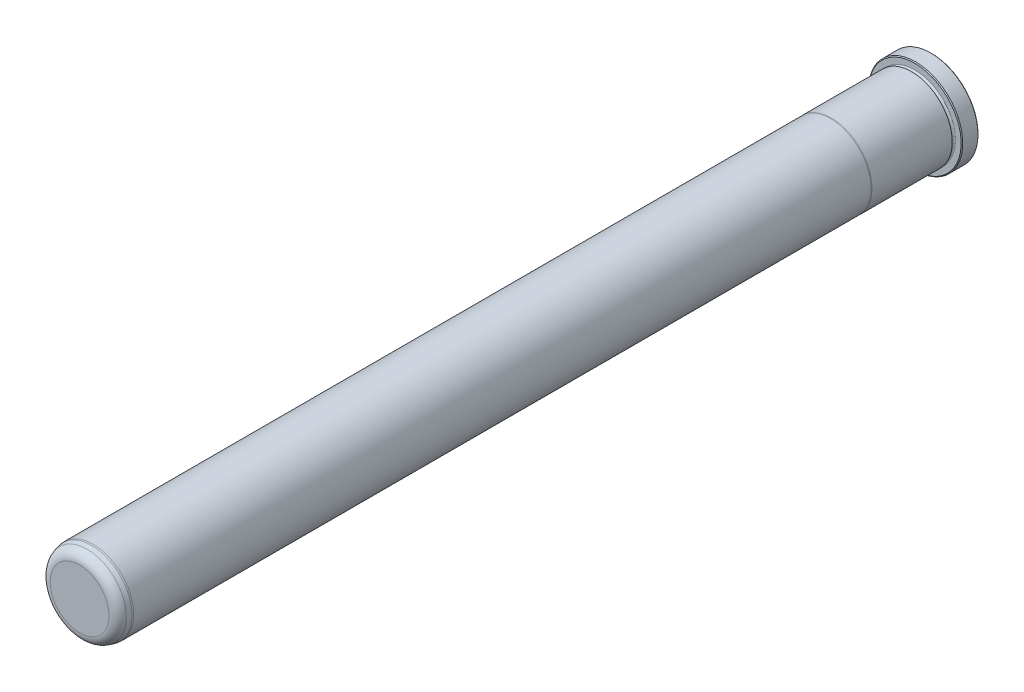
from build123d import *

# Parameters (mm, degrees)
FILLET6_R     = 4.7625
CHAMFER1_SIZE = 0.381


with BuildPart() as part:
    # Sketch1 → Revolve1 (revolve)
    with BuildSketch(Plane(origin=(0, 0, 0), x_dir=(0, 0, -1), z_dir=(1, 0, 0)), mode=Mode.PRIVATE) as revolve1_sk:
        with BuildLine():
            Line((0, 0), (0, 22.098))
            Line((0, 22.098), (-7.9248, 22.098))
            Line((-7.9248, 22.098), (-7.9248, 19.0373))
            ThreePointArc((-7.9248, 19.0373), (-8.6868, 18.2753), (-9.4488, 19.0373))
            Line((-9.4488, 19.0373), (-9.4488, 19.0627))
            Line((-9.4488, 19.0627), (-47.134763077, 19.0627))
            Line((-47.134763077, 19.0627), (-47.498, 19.0373))
            Line((-47.498, 19.0373), (-393.7, 19.0373))
            Line((-393.7, 19.0373), (-394.462, 18.970633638))
            Line((-394.462, 18.970633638), (-400.05, 17.473333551))
            Line((-400.05, 17.473333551), (-400.05, 0))
            Line((-400.05, 0), (0, 0))
        make_face()
    revolve(revolve1_sk.sketch.rotate(Axis((0, 0, 0), (0, 0, -1)), 90), axis=Axis((0, 0, 0), (0, 0, -1)))

    # Fillet6
    fillet6_edges = [part.edges().sort_by_distance(p)[0] for p in [
        (-17.473333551, 0, 400.05),
    ]]
    fillet(fillet6_edges, radius=FILLET6_R)

    # Chamfer1
    chamfer1_edges = [part.edges().sort_by_distance(p)[0] for p in [
        (-22.098, 0, 7.9248),
        (-22.098, 0, 0),
    ]]
    chamfer(chamfer1_edges, length=CHAMFER1_SIZE)


solid = part.part
